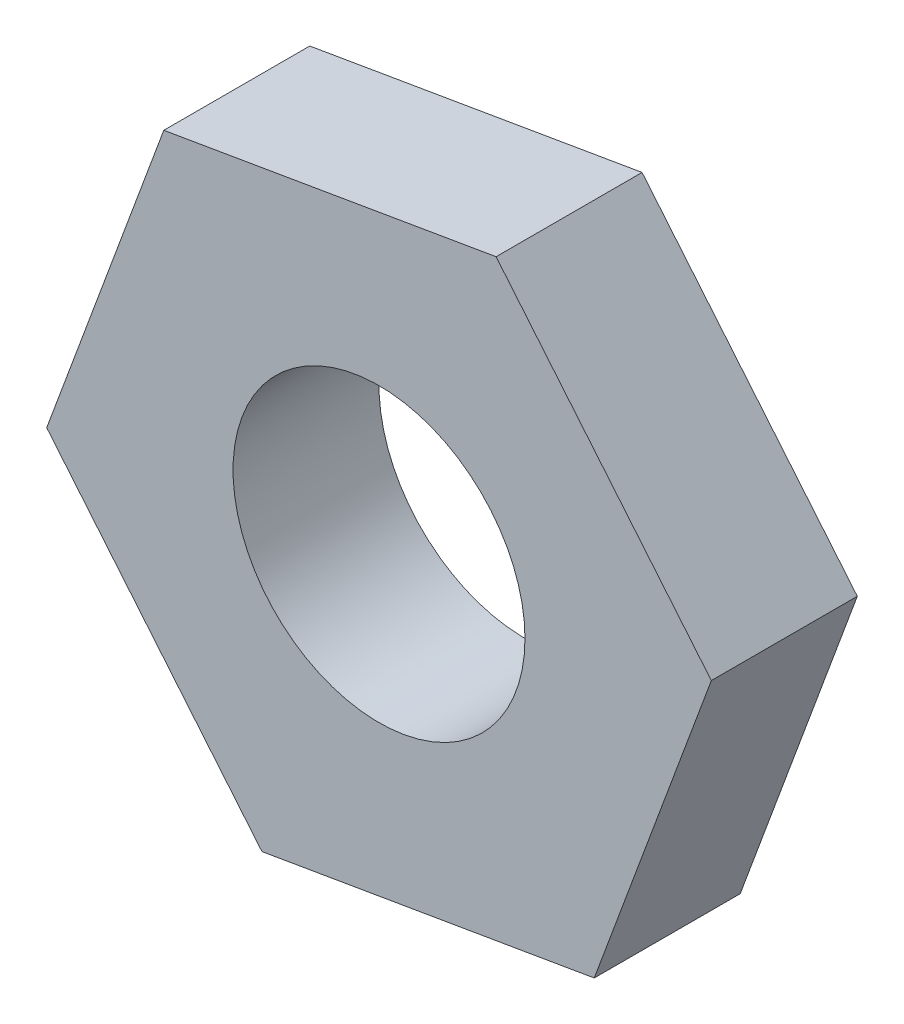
from build123d import *

# Parameters (mm, degrees)
ESQUISSE1_R      = 1.5
EXTRUSION1_DEPTH = 1.5


with BuildPart() as part:
    # Esquisse1 → Extrusion1 (new body)
    with BuildSketch(Plane.XY):
        Polygon((-2.2116626, 2.666186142), (-3.41481623, -0.582262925), (-1.20315363, -3.248449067), (2.2116626, -2.666186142), (3.41481623, 0.582262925), (1.20315363, 3.248449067), align=None)
        Circle(ESQUISSE1_R, mode=Mode.SUBTRACT)
    extrude(amount=EXTRUSION1_DEPTH)


solid = part.part
